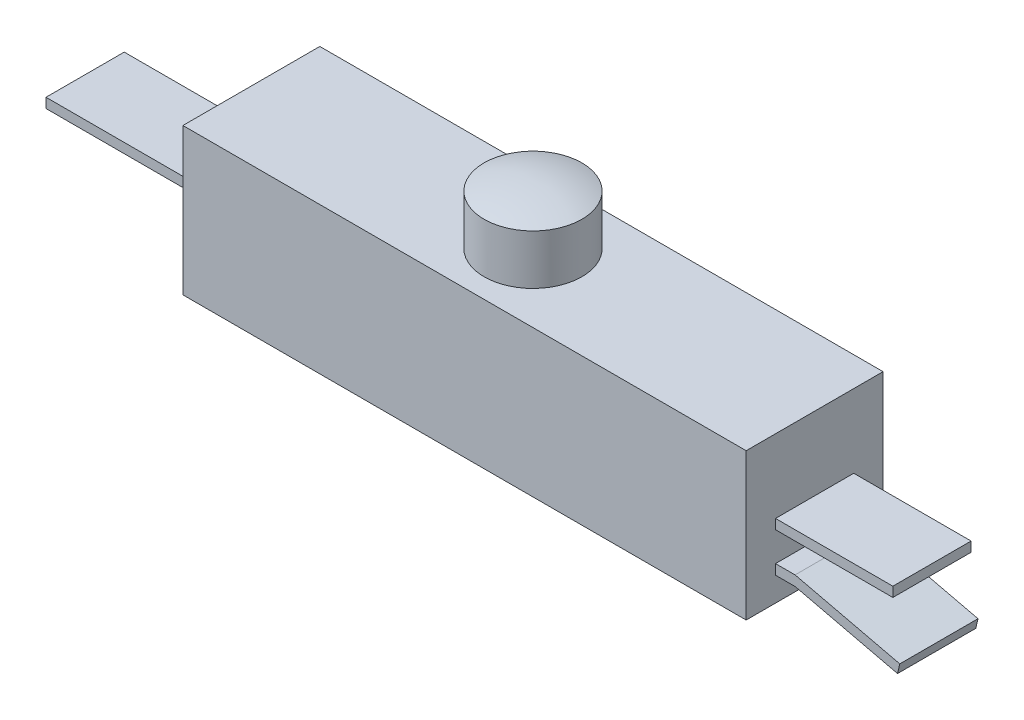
ISO-10303-21;
HEADER;
FILE_DESCRIPTION(('STEP AP214'),'2;1');
FILE_NAME('part.step','',(''),(''),'','','');
FILE_SCHEMA(('AUTOMOTIVE_DESIGN { 1 0 10303 214 1 1 1 1 }'));
ENDSEC;
DATA;
#1=APPLICATION_CONTEXT('core data for automotive mechanical design processes');
#2=APPLICATION_PROTOCOL_DEFINITION('international standard','automotive_design',2000,#1);
#3=PRODUCT_CONTEXT('',#1,'mechanical');
#4=PRODUCT('Part','Part','',(#3));
#5=PRODUCT_RELATED_PRODUCT_CATEGORY('part','',(#4));
#6=PRODUCT_DEFINITION_FORMATION('','',#4);
#7=PRODUCT_DEFINITION_CONTEXT('part definition',#1,'design');
#8=PRODUCT_DEFINITION('design','',#6,#7);
#9=PRODUCT_DEFINITION_SHAPE('','',#8);
#10=(LENGTH_UNIT() NAMED_UNIT(*) SI_UNIT(.MILLI.,.METRE.));
#11=(NAMED_UNIT(*) PLANE_ANGLE_UNIT() SI_UNIT($,.RADIAN.));
#12=(NAMED_UNIT(*) SI_UNIT($,.STERADIAN.) SOLID_ANGLE_UNIT());
#13=UNCERTAINTY_MEASURE_WITH_UNIT(LENGTH_MEASURE(1.E-05),#10,'distance_accuracy_value','');
#14=(GEOMETRIC_REPRESENTATION_CONTEXT(3) GLOBAL_UNCERTAINTY_ASSIGNED_CONTEXT((#13)) GLOBAL_UNIT_ASSIGNED_CONTEXT((#10,
#11,#12)) REPRESENTATION_CONTEXT('',''));
#15=CARTESIAN_POINT('',(0.,0.,0.));
#16=DIRECTION('',(0.,0.,1.));
#17=DIRECTION('',(1.,0.,0.));
#18=AXIS2_PLACEMENT_3D('',#15,#16,#17);
#19=CARTESIAN_POINT('',(22.86,11.90625,5.55625));
#20=DIRECTION('',(-1.,0.,0.));
#21=DIRECTION('',(0.,0.,1.));
#22=AXIS2_PLACEMENT_3D('',#19,#20,#21);
#23=PLANE('',#22);
#24=DIRECTION('',(0.,-1.,0.));
#25=VECTOR('',#24,1.);
#26=CARTESIAN_POINT('',(22.86,2.77812500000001,-3.175));
#27=LINE('',#26,#25);
#28=CARTESIAN_POINT('',(22.86,2.778125,-3.175));
#29=VERTEX_POINT('',#28);
#30=CARTESIAN_POINT('',(22.86,1.9625675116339,-3.175));
#31=VERTEX_POINT('',#30);
#32=EDGE_CURVE('E105',#29,#31,#27,.T.);
#33=ORIENTED_EDGE('',*,*,#32,.T.);
#34=DIRECTION('',(0.,0.,1.));
#35=VECTOR('',#34,1.);
#36=CARTESIAN_POINT('',(22.86,1.9625675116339,-3.175));
#37=LINE('',#36,#35);
#38=CARTESIAN_POINT('',(22.86,1.9625675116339,3.175));
#39=VERTEX_POINT('',#38);
#40=EDGE_CURVE('E100',#31,#39,#37,.T.);
#41=ORIENTED_EDGE('',*,*,#40,.T.);
#42=DIRECTION('',(0.,-1.,0.));
#43=VECTOR('',#42,1.);
#44=CARTESIAN_POINT('',(22.86,2.77812500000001,3.175));
#45=LINE('',#44,#43);
#46=CARTESIAN_POINT('',(22.86,2.77812500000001,3.175));
#47=VERTEX_POINT('',#46);
#48=EDGE_CURVE('E208',#47,#39,#45,.T.);
#49=ORIENTED_EDGE('',*,*,#48,.F.);
#50=DIRECTION('',(0.,0.,1.));
#51=VECTOR('',#50,1.);
#52=CARTESIAN_POINT('',(22.86,2.77812500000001,-3.175));
#53=LINE('',#52,#51);
#54=EDGE_CURVE('E211',#29,#47,#53,.T.);
#55=ORIENTED_EDGE('',*,*,#54,.F.);
#56=EDGE_LOOP('',(#33,#41,#49,#55));
#57=FACE_BOUND('',#56,.T.);
#58=DIRECTION('',(0.,0.,-1.));
#59=VECTOR('',#58,1.);
#60=CARTESIAN_POINT('',(22.86,0.,5.55625));
#61=LINE('',#60,#59);
#62=CARTESIAN_POINT('',(22.86,0.,5.55625));
#63=VERTEX_POINT('',#62);
#64=CARTESIAN_POINT('',(22.86,0.,-5.55625));
#65=VERTEX_POINT('',#64);
#66=EDGE_CURVE('E330',#63,#65,#61,.T.);
#67=ORIENTED_EDGE('',*,*,#66,.T.);
#68=DIRECTION('',(0.,-1.,0.));
#69=VECTOR('',#68,1.);
#70=CARTESIAN_POINT('',(22.86,11.90625,-5.55625));
#71=LINE('',#70,#69);
#72=CARTESIAN_POINT('',(22.86,11.90625,-5.55625));
#73=VERTEX_POINT('',#72);
#74=EDGE_CURVE('E93',#73,#65,#71,.T.);
#75=ORIENTED_EDGE('',*,*,#74,.F.);
#76=DIRECTION('',(0.,0.,-1.));
#77=VECTOR('',#76,1.);
#78=CARTESIAN_POINT('',(22.86,11.90625,5.55625));
#79=LINE('',#78,#77);
#80=CARTESIAN_POINT('',(22.86,11.90625,5.55625));
#81=VERTEX_POINT('',#80);
#82=EDGE_CURVE('E319',#81,#73,#79,.T.);
#83=ORIENTED_EDGE('',*,*,#82,.F.);
#84=DIRECTION('',(0.,-1.,0.));
#85=VECTOR('',#84,1.);
#86=CARTESIAN_POINT('',(22.86,11.90625,5.55625));
#87=LINE('',#86,#85);
#88=EDGE_CURVE('E329',#81,#63,#87,.T.);
#89=ORIENTED_EDGE('',*,*,#88,.T.);
#90=EDGE_LOOP('',(#67,#75,#83,#89));
#91=FACE_BOUND('',#90,.T.);
#92=DIRECTION('',(0.,-1.,0.));
#93=VECTOR('',#92,1.);
#94=CARTESIAN_POINT('',(22.86,5.953125,-3.175));
#95=LINE('',#94,#93);
#96=CARTESIAN_POINT('',(22.86,5.953125,-3.175));
#97=VERTEX_POINT('',#96);
#98=CARTESIAN_POINT('',(22.86,5.159375,-3.175));
#99=VERTEX_POINT('',#98);
#100=EDGE_CURVE('E299',#97,#99,#95,.T.);
#101=ORIENTED_EDGE('',*,*,#100,.T.);
#102=DIRECTION('',(0.,0.,1.));
#103=VECTOR('',#102,1.);
#104=CARTESIAN_POINT('',(22.86,5.159375,-3.175));
#105=LINE('',#104,#103);
#106=CARTESIAN_POINT('',(22.86,5.159375,3.175));
#107=VERTEX_POINT('',#106);
#108=EDGE_CURVE('E309',#99,#107,#105,.T.);
#109=ORIENTED_EDGE('',*,*,#108,.T.);
#110=DIRECTION('',(0.,-1.,0.));
#111=VECTOR('',#110,1.);
#112=CARTESIAN_POINT('',(22.86,5.953125,3.175));
#113=LINE('',#112,#111);
#114=CARTESIAN_POINT('',(22.86,5.95312500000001,3.175));
#115=VERTEX_POINT('',#114);
#116=EDGE_CURVE('E287',#115,#107,#113,.T.);
#117=ORIENTED_EDGE('',*,*,#116,.F.);
#118=DIRECTION('',(0.,0.,1.));
#119=VECTOR('',#118,1.);
#120=CARTESIAN_POINT('',(22.86,5.953125,-3.175));
#121=LINE('',#120,#119);
#122=EDGE_CURVE('E310',#97,#115,#121,.T.);
#123=ORIENTED_EDGE('',*,*,#122,.F.);
#124=EDGE_LOOP('',(#101,#109,#117,#123));
#125=FACE_BOUND('',#124,.T.);
#126=ADVANCED_FACE('F85',(#57,#91,#125),#23,.F.);
#127=CARTESIAN_POINT('',(-22.86,11.90625,-5.55625));
#128=DIRECTION('',(0.,0.,1.));
#129=DIRECTION('',(1.,0.,0.));
#130=AXIS2_PLACEMENT_3D('',#127,#128,#129);
#131=PLANE('',#130);
#132=DIRECTION('',(-1.,0.,0.));
#133=VECTOR('',#132,1.);
#134=CARTESIAN_POINT('',(-22.86,0.,-5.55625));
#135=LINE('',#134,#133);
#136=CARTESIAN_POINT('',(-22.86,0.,-5.55625));
#137=VERTEX_POINT('',#136);
#138=EDGE_CURVE('E333',#65,#137,#135,.T.);
#139=ORIENTED_EDGE('',*,*,#138,.T.);
#140=DIRECTION('',(0.,-1.,0.));
#141=VECTOR('',#140,1.);
#142=CARTESIAN_POINT('',(-22.86,11.90625,-5.55625));
#143=LINE('',#142,#141);
#144=CARTESIAN_POINT('',(-22.86,11.90625,-5.55625));
#145=VERTEX_POINT('',#144);
#146=EDGE_CURVE('E343',#145,#137,#143,.T.);
#147=ORIENTED_EDGE('',*,*,#146,.F.);
#148=DIRECTION('',(-1.,0.,0.));
#149=VECTOR('',#148,1.);
#150=CARTESIAN_POINT('',(-22.86,11.90625,-5.55625));
#151=LINE('',#150,#149);
#152=EDGE_CURVE('E322',#73,#145,#151,.T.);
#153=ORIENTED_EDGE('',*,*,#152,.F.);
#154=ORIENTED_EDGE('',*,*,#74,.T.);
#155=EDGE_LOOP('',(#139,#147,#153,#154));
#156=FACE_BOUND('',#155,.T.);
#157=ADVANCED_FACE('F349',(#156),#131,.F.);
#158=CARTESIAN_POINT('',(-22.86,11.90625,5.55625));
#159=DIRECTION('',(1.,0.,0.));
#160=DIRECTION('',(0.,0.,-1.));
#161=AXIS2_PLACEMENT_3D('',#158,#159,#160);
#162=PLANE('',#161);
#163=DIRECTION('',(0.,0.,1.));
#164=VECTOR('',#163,1.);
#165=CARTESIAN_POINT('',(-22.86,5.159375,-3.175));
#166=LINE('',#165,#164);
#167=CARTESIAN_POINT('',(-22.86,5.159375,-3.175));
#168=VERTEX_POINT('',#167);
#169=CARTESIAN_POINT('',(-22.86,5.159375,3.175));
#170=VERTEX_POINT('',#169);
#171=EDGE_CURVE('E231',#168,#170,#166,.T.);
#172=ORIENTED_EDGE('',*,*,#171,.F.);
#173=DIRECTION('',(0.,-1.,0.));
#174=VECTOR('',#173,1.);
#175=CARTESIAN_POINT('',(-22.86,5.953125,-3.175));
#176=LINE('',#175,#174);
#177=CARTESIAN_POINT('',(-22.86,5.953125,-3.175));
#178=VERTEX_POINT('',#177);
#179=EDGE_CURVE('E273',#178,#168,#176,.T.);
#180=ORIENTED_EDGE('',*,*,#179,.F.);
#181=DIRECTION('',(0.,0.,1.));
#182=VECTOR('',#181,1.);
#183=CARTESIAN_POINT('',(-22.86,5.953125,-3.175));
#184=LINE('',#183,#182);
#185=CARTESIAN_POINT('',(-22.86,5.953125,3.175));
#186=VERTEX_POINT('',#185);
#187=EDGE_CURVE('E263',#178,#186,#184,.T.);
#188=ORIENTED_EDGE('',*,*,#187,.T.);
#189=DIRECTION('',(0.,-1.,0.));
#190=VECTOR('',#189,1.);
#191=CARTESIAN_POINT('',(-22.86,5.953125,3.175));
#192=LINE('',#191,#190);
#193=EDGE_CURVE('E285',#186,#170,#192,.T.);
#194=ORIENTED_EDGE('',*,*,#193,.T.);
#195=EDGE_LOOP('',(#172,#180,#188,#194));
#196=FACE_BOUND('',#195,.T.);
#197=DIRECTION('',(0.,0.,1.));
#198=VECTOR('',#197,1.);
#199=CARTESIAN_POINT('',(-22.86,0.,5.55625));
#200=LINE('',#199,#198);
#201=CARTESIAN_POINT('',(-22.86,0.,5.55625));
#202=VERTEX_POINT('',#201);
#203=EDGE_CURVE('E335',#137,#202,#200,.T.);
#204=ORIENTED_EDGE('',*,*,#203,.T.);
#205=DIRECTION('',(0.,-1.,0.));
#206=VECTOR('',#205,1.);
#207=CARTESIAN_POINT('',(-22.86,11.90625,5.55625));
#208=LINE('',#207,#206);
#209=CARTESIAN_POINT('',(-22.86,11.90625,5.55625));
#210=VERTEX_POINT('',#209);
#211=EDGE_CURVE('E340',#210,#202,#208,.T.);
#212=ORIENTED_EDGE('',*,*,#211,.F.);
#213=DIRECTION('',(0.,0.,1.));
#214=VECTOR('',#213,1.);
#215=CARTESIAN_POINT('',(-22.86,11.90625,5.55625));
#216=LINE('',#215,#214);
#217=EDGE_CURVE('E325',#145,#210,#216,.T.);
#218=ORIENTED_EDGE('',*,*,#217,.F.);
#219=ORIENTED_EDGE('',*,*,#146,.T.);
#220=EDGE_LOOP('',(#204,#212,#218,#219));
#221=FACE_BOUND('',#220,.T.);
#222=ADVANCED_FACE('F361',(#196,#221),#162,.F.);
#223=CARTESIAN_POINT('',(-22.86,11.90625,5.55625));
#224=DIRECTION('',(0.,0.,-1.));
#225=DIRECTION('',(-1.,0.,0.));
#226=AXIS2_PLACEMENT_3D('',#223,#224,#225);
#227=PLANE('',#226);
#228=DIRECTION('',(1.,0.,0.));
#229=VECTOR('',#228,1.);
#230=CARTESIAN_POINT('',(-22.86,0.,5.55625));
#231=LINE('',#230,#229);
#232=EDGE_CURVE('E323',#202,#63,#231,.T.);
#233=ORIENTED_EDGE('',*,*,#232,.T.);
#234=ORIENTED_EDGE('',*,*,#88,.F.);
#235=DIRECTION('',(1.,0.,0.));
#236=VECTOR('',#235,1.);
#237=CARTESIAN_POINT('',(-22.86,11.90625,5.55625));
#238=LINE('',#237,#236);
#239=EDGE_CURVE('E327',#210,#81,#238,.T.);
#240=ORIENTED_EDGE('',*,*,#239,.F.);
#241=ORIENTED_EDGE('',*,*,#211,.T.);
#242=EDGE_LOOP('',(#233,#234,#240,#241));
#243=FACE_BOUND('',#242,.T.);
#244=ADVANCED_FACE('F365',(#243),#227,.F.);
#245=CARTESIAN_POINT('',(0.,11.90625,0.));
#246=DIRECTION('',(0.,-1.,0.));
#247=DIRECTION('',(0.,0.,-1.));
#248=AXIS2_PLACEMENT_3D('',#245,#246,#247);
#249=PLANE('',#248);
#250=CARTESIAN_POINT('',(0.,11.90625,0.));
#251=DIRECTION('',(0.,-1.,0.));
#252=DIRECTION('',(0.,0.,-1.));
#253=AXIS2_PLACEMENT_3D('',#250,#251,#252);
#254=CIRCLE('',#253,3.96875);
#255=CARTESIAN_POINT('',(0.,11.90625,-3.96875));
#256=VERTEX_POINT('',#255);
#257=EDGE_CURVE('E12',#256,#256,#254,.F.);
#258=ORIENTED_EDGE('',*,*,#257,.F.);
#259=EDGE_LOOP('',(#258));
#260=FACE_BOUND('',#259,.T.);
#261=ORIENTED_EDGE('',*,*,#82,.T.);
#262=ORIENTED_EDGE('',*,*,#152,.T.);
#263=ORIENTED_EDGE('',*,*,#217,.T.);
#264=ORIENTED_EDGE('',*,*,#239,.T.);
#265=EDGE_LOOP('',(#261,#262,#263,#264));
#266=FACE_BOUND('',#265,.T.);
#267=ADVANCED_FACE('F367',(#260,#266),#249,.F.);
#268=CARTESIAN_POINT('',(0.,0.,0.));
#269=DIRECTION('',(0.,-1.,0.));
#270=DIRECTION('',(0.,0.,-1.));
#271=AXIS2_PLACEMENT_3D('',#268,#269,#270);
#272=PLANE('',#271);
#273=ORIENTED_EDGE('',*,*,#66,.F.);
#274=ORIENTED_EDGE('',*,*,#232,.F.);
#275=ORIENTED_EDGE('',*,*,#203,.F.);
#276=ORIENTED_EDGE('',*,*,#138,.F.);
#277=EDGE_LOOP('',(#273,#274,#275,#276));
#278=FACE_BOUND('',#277,.T.);
#279=ADVANCED_FACE('F357',(#278),#272,.T.);
#280=CARTESIAN_POINT('',(0.,16.66875,0.));
#281=DIRECTION('',(0.,-1.,0.));
#282=DIRECTION('',(0.,0.,-1.));
#283=AXIS2_PLACEMENT_3D('',#280,#281,#282);
#284=CYLINDRICAL_SURFACE('',#283,3.96875);
#285=CARTESIAN_POINT('',(0.,15.9484729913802,0.));
#286=DIRECTION('',(0.,-1.,0.));
#287=DIRECTION('',(0.,0.,-1.));
#288=AXIS2_PLACEMENT_3D('',#285,#286,#287);
#289=CIRCLE('',#288,3.96875);
#290=CARTESIAN_POINT('',(0.,15.9484729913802,-3.96875));
#291=VERTEX_POINT('',#290);
#292=EDGE_CURVE('E88',#291,#291,#289,.T.);
#293=CARTESIAN_POINT('',(0.,15.9484729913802,-3.96875));
#294=CARTESIAN_POINT('',(0.,15.9063665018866,-3.96875));
#295=CARTESIAN_POINT('',(0.,15.8642600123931,-3.96875));
#296=CARTESIAN_POINT('',(0.,15.780047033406,-3.96875));
#297=CARTESIAN_POINT('',(0.,15.7379405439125,-3.96875));
#298=CARTESIAN_POINT('',(0.,15.6537275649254,-3.96875));
#299=CARTESIAN_POINT('',(0.,15.6116210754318,-3.96875));
#300=CARTESIAN_POINT('',(0.,15.5274080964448,-3.96875));
#301=CARTESIAN_POINT('',(0.,15.4853016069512,-3.96875));
#302=CARTESIAN_POINT('',(0.,15.4010886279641,-3.96875));
#303=CARTESIAN_POINT('',(0.,15.3589821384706,-3.96875));
#304=CARTESIAN_POINT('',(0.,15.2747691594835,-3.96875));
#305=CARTESIAN_POINT('',(0.,15.2326626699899,-3.96875));
#306=CARTESIAN_POINT('',(0.,15.1484496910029,-3.96875));
#307=CARTESIAN_POINT('',(0.,15.1063432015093,-3.96875));
#308=CARTESIAN_POINT('',(0.,15.0221302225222,-3.96875));
#309=CARTESIAN_POINT('',(0.,14.9800237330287,-3.96875));
#310=CARTESIAN_POINT('',(0.,14.8958107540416,-3.96875));
#311=CARTESIAN_POINT('',(0.,14.8537042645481,-3.96875));
#312=CARTESIAN_POINT('',(0.,14.769491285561,-3.96875));
#313=CARTESIAN_POINT('',(0.,14.7273847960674,-3.96875));
#314=CARTESIAN_POINT('',(0.,14.6431718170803,-3.96875));
#315=CARTESIAN_POINT('',(0.,14.6010653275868,-3.96875));
#316=CARTESIAN_POINT('',(0.,14.5168523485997,-3.96875));
#317=CARTESIAN_POINT('',(0.,14.4747458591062,-3.96875));
#318=CARTESIAN_POINT('',(0.,14.3905328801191,-3.96875));
#319=CARTESIAN_POINT('',(0.,14.3484263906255,-3.96875));
#320=CARTESIAN_POINT('',(0.,14.2642134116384,-3.96875));
#321=CARTESIAN_POINT('',(0.,14.2221069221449,-3.96875));
#322=CARTESIAN_POINT('',(0.,14.1378939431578,-3.96875));
#323=CARTESIAN_POINT('',(0.,14.0957874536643,-3.96875));
#324=CARTESIAN_POINT('',(0.,14.0115744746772,-3.96875));
#325=CARTESIAN_POINT('',(0.,13.9694679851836,-3.96875));
#326=CARTESIAN_POINT('',(0.,13.8852550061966,-3.96875));
#327=CARTESIAN_POINT('',(0.,13.843148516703,-3.96875));
#328=CARTESIAN_POINT('',(0.,13.7589355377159,-3.96875));
#329=CARTESIAN_POINT('',(0.,13.7168290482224,-3.96875));
#330=CARTESIAN_POINT('',(0.,13.6326160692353,-3.96875));
#331=CARTESIAN_POINT('',(0.,13.5905095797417,-3.96875));
#332=CARTESIAN_POINT('',(0.,13.5062966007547,-3.96875));
#333=CARTESIAN_POINT('',(0.,13.4641901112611,-3.96875));
#334=CARTESIAN_POINT('',(0.,13.379977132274,-3.96875));
#335=CARTESIAN_POINT('',(0.,13.3378706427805,-3.96875));
#336=CARTESIAN_POINT('',(0.,13.2536576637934,-3.96875));
#337=CARTESIAN_POINT('',(0.,13.2115511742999,-3.96875));
#338=CARTESIAN_POINT('',(0.,13.1273381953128,-3.96875));
#339=CARTESIAN_POINT('',(0.,13.0852317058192,-3.96875));
#340=CARTESIAN_POINT('',(0.,13.0010187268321,-3.96875));
#341=CARTESIAN_POINT('',(0.,12.9589122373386,-3.96875));
#342=CARTESIAN_POINT('',(0.,12.8746992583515,-3.96875));
#343=CARTESIAN_POINT('',(0.,12.832592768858,-3.96875));
#344=CARTESIAN_POINT('',(0.,12.7483797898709,-3.96875));
#345=CARTESIAN_POINT('',(0.,12.7062733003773,-3.96875));
#346=CARTESIAN_POINT('',(0.,12.6220603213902,-3.96875));
#347=CARTESIAN_POINT('',(0.,12.5799538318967,-3.96875));
#348=CARTESIAN_POINT('',(0.,12.4957408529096,-3.96875));
#349=CARTESIAN_POINT('',(0.,12.4536343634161,-3.96875));
#350=CARTESIAN_POINT('',(0.,12.369421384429,-3.96875));
#351=CARTESIAN_POINT('',(0.,12.3273148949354,-3.96875));
#352=CARTESIAN_POINT('',(0.,12.2431019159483,-3.96875));
#353=CARTESIAN_POINT('',(0.,12.2009954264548,-3.96875));
#354=CARTESIAN_POINT('',(0.,12.1167824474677,-3.96875));
#355=CARTESIAN_POINT('',(0.,12.0746759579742,-3.96875));
#356=CARTESIAN_POINT('',(0.,11.9904629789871,-3.96875));
#357=CARTESIAN_POINT('',(0.,11.9483564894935,-3.96875));
#358=CARTESIAN_POINT('',(0.,11.90625,-3.96875));
#359=B_SPLINE_CURVE_WITH_KNOTS('',3,(#293,#294,#295,#296,#297,#298,#299,#300,#301,#302,#303,
#304,#305,#306,#307,#308,#309,#310,#311,#312,#313,#314,#315,#316,#317,#318,#319,#320,#321,#322,
#323,#324,#325,#326,#327,#328,#329,#330,#331,#332,#333,#334,#335,#336,#337,#338,#339,#340,#341,
#342,#343,#344,#345,#346,#347,#348,#349,#350,#351,#352,#353,#354,#355,#356,#357,#358),
.UNSPECIFIED.,.F.,.F.,(4,2,2,2,2,2,2,2,2,2,2,2,2,2,2,2,2,2,2,2,2,2,2,2,2,2,2,2,2,2,2,2,4),(0.,
0.126319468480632,0.252638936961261,0.378958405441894,0.505277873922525,0.631597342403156,
0.757916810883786,0.884236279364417,1.01055574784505,1.13687521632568,1.26319468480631,
1.38951415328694,1.51583362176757,1.6421530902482,1.76847255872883,1.89479202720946,
2.02111149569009,2.14743096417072,2.27375043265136,2.40006990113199,2.52638936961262,
2.65270883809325,2.77902830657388,2.90534777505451,3.03166724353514,3.15798671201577,
3.2843061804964,3.41062564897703,3.53694511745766,3.66326458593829,3.78958405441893,
3.91590352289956,4.04222299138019),.UNSPECIFIED.);
#360=EDGE_CURVE('BSEAM375',#291,#256,#359,.T.);
#361=ORIENTED_EDGE('',*,*,#292,.T.);
#362=ORIENTED_EDGE('',*,*,#257,.T.);
#363=ORIENTED_EDGE('',*,*,#360,.T.);
#364=ORIENTED_EDGE('',*,*,#360,.F.);
#365=EDGE_LOOP('',(#361,#363,#362,#364));
#366=FACE_BOUND('',#365,.T.);
#367=ADVANCED_FACE('F375',(#366),#284,.T.);
#368=CARTESIAN_POINT('',(0.,5.37463999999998,0.));
#369=DIRECTION('',(0.,-1.,0.));
#370=DIRECTION('',(-1.,0.,0.));
#371=AXIS2_PLACEMENT_3D('',#368,#369,#370);
#372=SPHERICAL_SURFACE('',#371,11.29411);
#373=CARTESIAN_POINT('',(0.,16.66875,0.));
#374=VERTEX_POINT('',#373);
#375=VERTEX_LOOP('',#374);
#376=FACE_BOUND('',#375,.T.);
#377=ORIENTED_EDGE('',*,*,#292,.F.);
#378=EDGE_LOOP('',(#377));
#379=FACE_BOUND('',#378,.T.);
#380=ADVANCED_FACE('F438',(#376,#379),#372,.T.);
#381=CARTESIAN_POINT('',(22.86,5.953125,-3.175));
#382=DIRECTION('',(0.,-1.,0.));
#383=DIRECTION('',(1.,0.,0.));
#384=AXIS2_PLACEMENT_3D('',#381,#382,#383);
#385=PLANE('',#384);
#386=ORIENTED_EDGE('',*,*,#122,.T.);
#387=DIRECTION('',(1.,0.,0.));
#388=VECTOR('',#387,1.);
#389=CARTESIAN_POINT('',(22.86,5.953125,3.175));
#390=LINE('',#389,#388);
#391=CARTESIAN_POINT('',(32.385,5.95312500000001,3.175));
#392=VERTEX_POINT('',#391);
#393=EDGE_CURVE('E296',#115,#392,#390,.T.);
#394=ORIENTED_EDGE('',*,*,#393,.T.);
#395=DIRECTION('',(0.,0.,1.));
#396=VECTOR('',#395,1.);
#397=CARTESIAN_POINT('',(32.385,5.95312500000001,-3.175));
#398=LINE('',#397,#396);
#399=CARTESIAN_POINT('',(32.385,5.95312500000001,-3.175));
#400=VERTEX_POINT('',#399);
#401=EDGE_CURVE('E313',#400,#392,#398,.T.);
#402=ORIENTED_EDGE('',*,*,#401,.F.);
#403=DIRECTION('',(1.,0.,0.));
#404=VECTOR('',#403,1.);
#405=CARTESIAN_POINT('',(22.86,5.953125,-3.175));
#406=LINE('',#405,#404);
#407=EDGE_CURVE('E307',#97,#400,#406,.T.);
#408=ORIENTED_EDGE('',*,*,#407,.F.);
#409=EDGE_LOOP('',(#386,#394,#402,#408));
#410=FACE_BOUND('',#409,.T.);
#411=ADVANCED_FACE('F434',(#410),#385,.F.);
#412=CARTESIAN_POINT('',(32.385,5.95312500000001,-3.175));
#413=DIRECTION('',(-1.,0.,0.));
#414=DIRECTION('',(0.,0.,1.));
#415=AXIS2_PLACEMENT_3D('',#412,#413,#414);
#416=PLANE('',#415);
#417=ORIENTED_EDGE('',*,*,#401,.T.);
#418=DIRECTION('',(0.,-1.,0.));
#419=VECTOR('',#418,1.);
#420=CARTESIAN_POINT('',(32.385,5.95312500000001,3.175));
#421=LINE('',#420,#419);
#422=CARTESIAN_POINT('',(32.385,5.15937500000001,3.175));
#423=VERTEX_POINT('',#422);
#424=EDGE_CURVE('E293',#392,#423,#421,.T.);
#425=ORIENTED_EDGE('',*,*,#424,.T.);
#426=DIRECTION('',(0.,0.,1.));
#427=VECTOR('',#426,1.);
#428=CARTESIAN_POINT('',(32.385,5.15937500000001,-3.175));
#429=LINE('',#428,#427);
#430=CARTESIAN_POINT('',(32.385,5.15937500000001,-3.175));
#431=VERTEX_POINT('',#430);
#432=EDGE_CURVE('E315',#431,#423,#429,.T.);
#433=ORIENTED_EDGE('',*,*,#432,.F.);
#434=DIRECTION('',(0.,-1.,0.));
#435=VECTOR('',#434,1.);
#436=CARTESIAN_POINT('',(32.385,5.95312500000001,-3.175));
#437=LINE('',#436,#435);
#438=EDGE_CURVE('E305',#400,#431,#437,.T.);
#439=ORIENTED_EDGE('',*,*,#438,.F.);
#440=EDGE_LOOP('',(#417,#425,#433,#439));
#441=FACE_BOUND('',#440,.T.);
#442=ADVANCED_FACE('F437',(#441),#416,.F.);
#443=CARTESIAN_POINT('',(22.86,5.159375,-3.175));
#444=DIRECTION('',(0.,-1.,0.));
#445=DIRECTION('',(1.,0.,0.));
#446=AXIS2_PLACEMENT_3D('',#443,#444,#445);
#447=PLANE('',#446);
#448=ORIENTED_EDGE('',*,*,#432,.T.);
#449=DIRECTION('',(1.,0.,0.));
#450=VECTOR('',#449,1.);
#451=CARTESIAN_POINT('',(22.86,5.159375,3.175));
#452=LINE('',#451,#450);
#453=EDGE_CURVE('E290',#107,#423,#452,.T.);
#454=ORIENTED_EDGE('',*,*,#453,.F.);
#455=ORIENTED_EDGE('',*,*,#108,.F.);
#456=DIRECTION('',(1.,0.,0.));
#457=VECTOR('',#456,1.);
#458=CARTESIAN_POINT('',(22.86,5.159375,-3.175));
#459=LINE('',#458,#457);
#460=EDGE_CURVE('E302',#99,#431,#459,.T.);
#461=ORIENTED_EDGE('',*,*,#460,.T.);
#462=EDGE_LOOP('',(#448,#454,#455,#461));
#463=FACE_BOUND('',#462,.T.);
#464=ADVANCED_FACE('F432',(#463),#447,.T.);
#465=CARTESIAN_POINT('',(0.,0.,-3.175));
#466=DIRECTION('',(0.,0.,1.));
#467=DIRECTION('',(1.,0.,0.));
#468=AXIS2_PLACEMENT_3D('',#465,#466,#467);
#469=PLANE('',#468);
#470=ORIENTED_EDGE('',*,*,#100,.F.);
#471=ORIENTED_EDGE('',*,*,#407,.T.);
#472=ORIENTED_EDGE('',*,*,#438,.T.);
#473=ORIENTED_EDGE('',*,*,#460,.F.);
#474=EDGE_LOOP('',(#470,#471,#472,#473));
#475=FACE_BOUND('',#474,.T.);
#476=ADVANCED_FACE('F428',(#475),#469,.F.);
#477=CARTESIAN_POINT('',(0.,0.,3.175));
#478=DIRECTION('',(0.,0.,1.));
#479=DIRECTION('',(1.,0.,0.));
#480=AXIS2_PLACEMENT_3D('',#477,#478,#479);
#481=PLANE('',#480);
#482=ORIENTED_EDGE('',*,*,#116,.T.);
#483=ORIENTED_EDGE('',*,*,#453,.T.);
#484=ORIENTED_EDGE('',*,*,#424,.F.);
#485=ORIENTED_EDGE('',*,*,#393,.F.);
#486=EDGE_LOOP('',(#482,#483,#484,#485));
#487=FACE_BOUND('',#486,.T.);
#488=ADVANCED_FACE('F417',(#487),#481,.T.);
#489=CARTESIAN_POINT('',(-22.86,5.159375,-3.175));
#490=DIRECTION('',(0.,1.,0.));
#491=DIRECTION('',(-1.,0.,0.));
#492=AXIS2_PLACEMENT_3D('',#489,#490,#491);
#493=PLANE('',#492);
#494=ORIENTED_EDGE('',*,*,#171,.T.);
#495=DIRECTION('',(-1.,0.,0.));
#496=VECTOR('',#495,1.);
#497=CARTESIAN_POINT('',(-22.86,5.159375,3.175));
#498=LINE('',#497,#496);
#499=CARTESIAN_POINT('',(-36.35375,5.159375,3.175));
#500=VERTEX_POINT('',#499);
#501=EDGE_CURVE('E282',#170,#500,#498,.T.);
#502=ORIENTED_EDGE('',*,*,#501,.T.);
#503=DIRECTION('',(0.,0.,1.));
#504=VECTOR('',#503,1.);
#505=CARTESIAN_POINT('',(-36.35375,5.159375,-3.175));
#506=LINE('',#505,#504);
#507=CARTESIAN_POINT('',(-36.35375,5.159375,-3.175));
#508=VERTEX_POINT('',#507);
#509=EDGE_CURVE('E234',#508,#500,#506,.T.);
#510=ORIENTED_EDGE('',*,*,#509,.F.);
#511=DIRECTION('',(-1.,0.,0.));
#512=VECTOR('',#511,1.);
#513=CARTESIAN_POINT('',(-22.86,5.159375,-3.175));
#514=LINE('',#513,#512);
#515=EDGE_CURVE('E271',#168,#508,#514,.T.);
#516=ORIENTED_EDGE('',*,*,#515,.F.);
#517=EDGE_LOOP('',(#494,#502,#510,#516));
#518=FACE_BOUND('',#517,.T.);
#519=ADVANCED_FACE('F397',(#518),#493,.F.);
#520=CARTESIAN_POINT('',(-36.35375,5.953125,-3.175));
#521=DIRECTION('',(-1.,0.,0.));
#522=DIRECTION('',(0.,0.,1.));
#523=AXIS2_PLACEMENT_3D('',#520,#521,#522);
#524=PLANE('',#523);
#525=ORIENTED_EDGE('',*,*,#509,.T.);
#526=DIRECTION('',(0.,-1.,0.));
#527=VECTOR('',#526,1.);
#528=CARTESIAN_POINT('',(-36.35375,5.953125,3.175));
#529=LINE('',#528,#527);
#530=CARTESIAN_POINT('',(-36.35375,5.953125,3.175));
#531=VERTEX_POINT('',#530);
#532=EDGE_CURVE('E279',#531,#500,#529,.T.);
#533=ORIENTED_EDGE('',*,*,#532,.F.);
#534=DIRECTION('',(0.,0.,1.));
#535=VECTOR('',#534,1.);
#536=CARTESIAN_POINT('',(-36.35375,5.953125,-3.175));
#537=LINE('',#536,#535);
#538=CARTESIAN_POINT('',(-36.35375,5.953125,-3.175));
#539=VERTEX_POINT('',#538);
#540=EDGE_CURVE('E261',#539,#531,#537,.T.);
#541=ORIENTED_EDGE('',*,*,#540,.F.);
#542=DIRECTION('',(0.,-1.,0.));
#543=VECTOR('',#542,1.);
#544=CARTESIAN_POINT('',(-36.35375,5.953125,-3.175));
#545=LINE('',#544,#543);
#546=EDGE_CURVE('E268',#539,#508,#545,.T.);
#547=ORIENTED_EDGE('',*,*,#546,.T.);
#548=EDGE_LOOP('',(#525,#533,#541,#547));
#549=FACE_BOUND('',#548,.T.);
#550=ADVANCED_FACE('F409',(#549),#524,.T.);
#551=CARTESIAN_POINT('',(-22.86,5.953125,-3.175));
#552=DIRECTION('',(0.,1.,0.));
#553=DIRECTION('',(-1.,0.,0.));
#554=AXIS2_PLACEMENT_3D('',#551,#552,#553);
#555=PLANE('',#554);
#556=ORIENTED_EDGE('',*,*,#540,.T.);
#557=DIRECTION('',(-1.,0.,0.));
#558=VECTOR('',#557,1.);
#559=CARTESIAN_POINT('',(-22.86,5.953125,3.175));
#560=LINE('',#559,#558);
#561=EDGE_CURVE('E276',#186,#531,#560,.T.);
#562=ORIENTED_EDGE('',*,*,#561,.F.);
#563=ORIENTED_EDGE('',*,*,#187,.F.);
#564=DIRECTION('',(-1.,0.,0.));
#565=VECTOR('',#564,1.);
#566=CARTESIAN_POINT('',(-22.86,5.953125,-3.175));
#567=LINE('',#566,#565);
#568=EDGE_CURVE('E265',#178,#539,#567,.T.);
#569=ORIENTED_EDGE('',*,*,#568,.T.);
#570=EDGE_LOOP('',(#556,#562,#563,#569));
#571=FACE_BOUND('',#570,.T.);
#572=ADVANCED_FACE('F403',(#571),#555,.T.);
#573=CARTESIAN_POINT('',(0.,0.,-3.175));
#574=DIRECTION('',(0.,0.,-1.));
#575=DIRECTION('',(-1.,0.,0.));
#576=AXIS2_PLACEMENT_3D('',#573,#574,#575);
#577=PLANE('',#576);
#578=ORIENTED_EDGE('',*,*,#179,.T.);
#579=ORIENTED_EDGE('',*,*,#515,.T.);
#580=ORIENTED_EDGE('',*,*,#546,.F.);
#581=ORIENTED_EDGE('',*,*,#568,.F.);
#582=EDGE_LOOP('',(#578,#579,#580,#581));
#583=FACE_BOUND('',#582,.T.);
#584=ADVANCED_FACE('F401',(#583),#577,.T.);
#585=CARTESIAN_POINT('',(0.,0.,3.175));
#586=DIRECTION('',(0.,0.,-1.));
#587=DIRECTION('',(-1.,0.,0.));
#588=AXIS2_PLACEMENT_3D('',#585,#586,#587);
#589=PLANE('',#588);
#590=ORIENTED_EDGE('',*,*,#193,.F.);
#591=ORIENTED_EDGE('',*,*,#561,.T.);
#592=ORIENTED_EDGE('',*,*,#532,.T.);
#593=ORIENTED_EDGE('',*,*,#501,.F.);
#594=EDGE_LOOP('',(#590,#591,#592,#593));
#595=FACE_BOUND('',#594,.T.);
#596=ADVANCED_FACE('F407',(#595),#589,.F.);
#597=CARTESIAN_POINT('',(0.,0.,3.175));
#598=DIRECTION('',(0.,0.,1.));
#599=DIRECTION('',(1.,0.,0.));
#600=AXIS2_PLACEMENT_3D('',#597,#598,#599);
#601=PLANE('',#600);
#602=DIRECTION('',(1.,0.,0.));
#603=VECTOR('',#602,1.);
#604=CARTESIAN_POINT('',(22.86,1.9625675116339,3.175));
#605=LINE('',#604,#603);
#606=CARTESIAN_POINT('',(24.4475,1.9625675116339,3.175));
#607=VERTEX_POINT('',#606);
#608=EDGE_CURVE('E217',#39,#607,#605,.T.);
#609=ORIENTED_EDGE('',*,*,#608,.T.);
#610=DIRECTION('',(0.973260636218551,-0.229703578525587,0.));
#611=VECTOR('',#610,1.);
#612=CARTESIAN_POINT('',(24.2651727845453,2.00559937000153,3.175));
#613=LINE('',#612,#611);
#614=CARTESIAN_POINT('',(32.7629547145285,0.,3.175));
#615=VERTEX_POINT('',#614);
#616=EDGE_CURVE('E258',#607,#615,#613,.T.);
#617=ORIENTED_EDGE('',*,*,#616,.T.);
#618=DIRECTION('',(-0.229703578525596,-0.973260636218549,0.));
#619=VECTOR('',#618,1.);
#620=CARTESIAN_POINT('',(32.9452819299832,0.772525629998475,3.175));
#621=LINE('',#620,#619);
#622=CARTESIAN_POINT('',(32.9452819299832,0.772525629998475,3.175));
#623=VERTEX_POINT('',#622);
#624=EDGE_CURVE('E255',#623,#615,#621,.T.);
#625=ORIENTED_EDGE('',*,*,#624,.F.);
#626=DIRECTION('',(0.973260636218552,-0.229703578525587,0.));
#627=VECTOR('',#626,1.);
#628=CARTESIAN_POINT('',(24.4475,2.77812500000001,3.175));
#629=LINE('',#628,#627);
#630=CARTESIAN_POINT('',(24.4475,2.77812500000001,3.175));
#631=VERTEX_POINT('',#630);
#632=EDGE_CURVE('E230',#631,#623,#629,.T.);
#633=ORIENTED_EDGE('',*,*,#632,.F.);
#634=DIRECTION('',(1.,0.,0.));
#635=VECTOR('',#634,1.);
#636=CARTESIAN_POINT('',(22.86,2.77812500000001,3.175));
#637=LINE('',#636,#635);
#638=EDGE_CURVE('E223',#47,#631,#637,.T.);
#639=ORIENTED_EDGE('',*,*,#638,.F.);
#640=ORIENTED_EDGE('',*,*,#48,.T.);
#641=EDGE_LOOP('',(#609,#617,#625,#633,#639,#640));
#642=FACE_BOUND('',#641,.T.);
#643=ADVANCED_FACE('F227',(#642),#601,.T.);
#644=CARTESIAN_POINT('',(0.,0.,-3.175));
#645=DIRECTION('',(0.,0.,1.));
#646=DIRECTION('',(1.,0.,0.));
#647=AXIS2_PLACEMENT_3D('',#644,#645,#646);
#648=PLANE('',#647);
#649=DIRECTION('',(1.,0.,0.));
#650=VECTOR('',#649,1.);
#651=CARTESIAN_POINT('',(22.86,2.77812500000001,-3.175));
#652=LINE('',#651,#650);
#653=CARTESIAN_POINT('',(24.4475,2.77812500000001,-3.175));
#654=VERTEX_POINT('',#653);
#655=EDGE_CURVE('E218',#29,#654,#652,.T.);
#656=ORIENTED_EDGE('',*,*,#655,.T.);
#657=DIRECTION('',(0.973260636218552,-0.229703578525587,0.));
#658=VECTOR('',#657,1.);
#659=CARTESIAN_POINT('',(24.4475,2.77812500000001,-3.175));
#660=LINE('',#659,#658);
#661=CARTESIAN_POINT('',(32.9452819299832,0.772525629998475,-3.175));
#662=VERTEX_POINT('',#661);
#663=EDGE_CURVE('E244',#654,#662,#660,.T.);
#664=ORIENTED_EDGE('',*,*,#663,.T.);
#665=DIRECTION('',(-0.229703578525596,-0.973260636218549,0.));
#666=VECTOR('',#665,1.);
#667=CARTESIAN_POINT('',(32.9452819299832,0.772525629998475,-3.175));
#668=LINE('',#667,#666);
#669=CARTESIAN_POINT('',(32.7629547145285,0.,-3.175));
#670=VERTEX_POINT('',#669);
#671=EDGE_CURVE('E249',#662,#670,#668,.T.);
#672=ORIENTED_EDGE('',*,*,#671,.T.);
#673=DIRECTION('',(0.973260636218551,-0.229703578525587,0.));
#674=VECTOR('',#673,1.);
#675=CARTESIAN_POINT('',(24.2651727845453,2.00559937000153,-3.175));
#676=LINE('',#675,#674);
#677=CARTESIAN_POINT('',(24.4475,1.9625675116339,-3.175));
#678=VERTEX_POINT('',#677);
#679=EDGE_CURVE('E252',#678,#670,#676,.T.);
#680=ORIENTED_EDGE('',*,*,#679,.F.);
#681=DIRECTION('',(1.,0.,0.));
#682=VECTOR('',#681,1.);
#683=CARTESIAN_POINT('',(22.86,1.9625675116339,-3.175));
#684=LINE('',#683,#682);
#685=EDGE_CURVE('E580',#31,#678,#684,.T.);
#686=ORIENTED_EDGE('',*,*,#685,.F.);
#687=ORIENTED_EDGE('',*,*,#32,.F.);
#688=EDGE_LOOP('',(#656,#664,#672,#680,#686,#687));
#689=FACE_BOUND('',#688,.T.);
#690=ADVANCED_FACE('F518',(#689),#648,.F.);
#691=CARTESIAN_POINT('',(32.9452819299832,0.772525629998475,-3.175));
#692=DIRECTION('',(-0.973260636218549,0.229703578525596,0.));
#693=DIRECTION('',(-0.229703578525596,-0.973260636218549,0.));
#694=AXIS2_PLACEMENT_3D('',#691,#692,#693);
#695=PLANE('',#694);
#696=DIRECTION('',(0.,0.,1.));
#697=VECTOR('',#696,1.);
#698=CARTESIAN_POINT('',(32.9452819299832,0.772525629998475,-3.175));
#699=LINE('',#698,#697);
#700=EDGE_CURVE('E245',#662,#623,#699,.T.);
#701=ORIENTED_EDGE('',*,*,#700,.T.);
#702=ORIENTED_EDGE('',*,*,#624,.T.);
#703=DIRECTION('',(0.,0.,1.));
#704=VECTOR('',#703,1.);
#705=CARTESIAN_POINT('',(32.7629547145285,0.,-3.175));
#706=LINE('',#705,#704);
#707=EDGE_CURVE('E241',#670,#615,#706,.T.);
#708=ORIENTED_EDGE('',*,*,#707,.F.);
#709=ORIENTED_EDGE('',*,*,#671,.F.);
#710=EDGE_LOOP('',(#701,#702,#708,#709));
#711=FACE_BOUND('',#710,.T.);
#712=ADVANCED_FACE('F425',(#711),#695,.F.);
#713=CARTESIAN_POINT('',(24.2651727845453,2.00559937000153,-3.175));
#714=DIRECTION('',(-0.229703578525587,-0.973260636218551,0.));
#715=DIRECTION('',(0.973260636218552,-0.229703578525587,0.));
#716=AXIS2_PLACEMENT_3D('',#713,#714,#715);
#717=PLANE('',#716);
#718=DIRECTION('',(0.,0.,1.));
#719=VECTOR('',#718,1.);
#720=CARTESIAN_POINT('',(24.4475,1.9625675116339,-3.175));
#721=LINE('',#720,#719);
#722=EDGE_CURVE('E238',#678,#607,#721,.T.);
#723=ORIENTED_EDGE('',*,*,#722,.F.);
#724=ORIENTED_EDGE('',*,*,#679,.T.);
#725=ORIENTED_EDGE('',*,*,#707,.T.);
#726=ORIENTED_EDGE('',*,*,#616,.F.);
#727=EDGE_LOOP('',(#723,#724,#725,#726));
#728=FACE_BOUND('',#727,.T.);
#729=ADVANCED_FACE('F538',(#728),#717,.T.);
#730=CARTESIAN_POINT('',(24.4475,2.77812500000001,-3.175));
#731=DIRECTION('',(-0.229703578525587,-0.973260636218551,0.));
#732=DIRECTION('',(0.973260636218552,-0.229703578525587,0.));
#733=AXIS2_PLACEMENT_3D('',#730,#731,#732);
#734=PLANE('',#733);
#735=DIRECTION('',(0.,0.,1.));
#736=VECTOR('',#735,1.);
#737=CARTESIAN_POINT('',(24.4475,2.77812500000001,-3.175));
#738=LINE('',#737,#736);
#739=EDGE_CURVE('E240',#654,#631,#738,.T.);
#740=ORIENTED_EDGE('',*,*,#739,.T.);
#741=ORIENTED_EDGE('',*,*,#632,.T.);
#742=ORIENTED_EDGE('',*,*,#700,.F.);
#743=ORIENTED_EDGE('',*,*,#663,.F.);
#744=EDGE_LOOP('',(#740,#741,#742,#743));
#745=FACE_BOUND('',#744,.T.);
#746=ADVANCED_FACE('F519',(#745),#734,.F.);
#747=CARTESIAN_POINT('',(22.86,1.9625675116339,-3.175));
#748=DIRECTION('',(0.,-1.,0.));
#749=DIRECTION('',(0.,0.,-1.));
#750=AXIS2_PLACEMENT_3D('',#747,#748,#749);
#751=PLANE('',#750);
#752=ORIENTED_EDGE('',*,*,#722,.T.);
#753=ORIENTED_EDGE('',*,*,#608,.F.);
#754=ORIENTED_EDGE('',*,*,#40,.F.);
#755=ORIENTED_EDGE('',*,*,#685,.T.);
#756=EDGE_LOOP('',(#752,#753,#754,#755));
#757=FACE_BOUND('',#756,.T.);
#758=ADVANCED_FACE('F530',(#757),#751,.T.);
#759=CARTESIAN_POINT('',(22.86,2.77812500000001,-3.175));
#760=DIRECTION('',(0.,-1.,0.));
#761=DIRECTION('',(0.,0.,-1.));
#762=AXIS2_PLACEMENT_3D('',#759,#760,#761);
#763=PLANE('',#762);
#764=ORIENTED_EDGE('',*,*,#54,.T.);
#765=ORIENTED_EDGE('',*,*,#638,.T.);
#766=ORIENTED_EDGE('',*,*,#739,.F.);
#767=ORIENTED_EDGE('',*,*,#655,.F.);
#768=EDGE_LOOP('',(#764,#765,#766,#767));
#769=FACE_BOUND('',#768,.T.);
#770=ADVANCED_FACE('F222',(#769),#763,.F.);
#771=CLOSED_SHELL('',(#126,#157,#222,#244,#267,#279,#367,#380,#411,#442,#464,#476,#488,#519,
#550,#572,#584,#596,#643,#690,#712,#729,#746,#758,#770));
#772=MANIFOLD_SOLID_BREP('B2',#771);
#773=ADVANCED_BREP_SHAPE_REPRESENTATION('',(#18,#772),#14);
#774=SHAPE_DEFINITION_REPRESENTATION(#9,#773);
ENDSEC;
END-ISO-10303-21;
